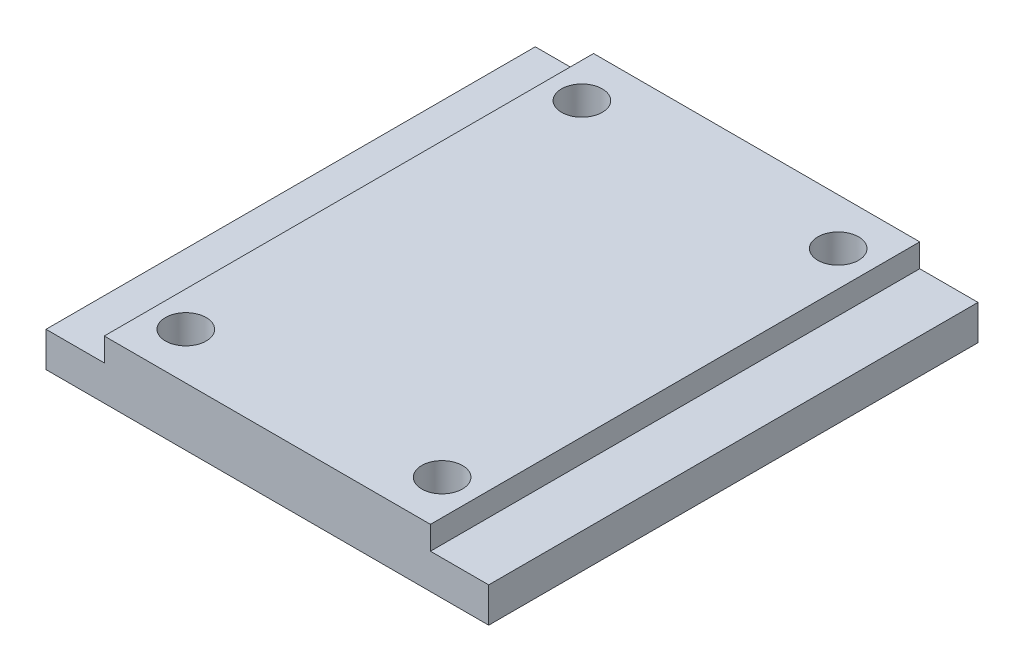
from build123d import *

# Parameters (mm, degrees)
BOSS_EXTRU_1_DEPTH        = 21
ESQUISSE2_R               = 1.75
ENL_V_MAT_EXTRU_1_DEPTH   = 29.757607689
ENL_V_MAT_EXTRU_2_DEPTH   = 2.5
SYM_TRIE2_COPY_1_SKETCH_R = 1.75
SYM_TRIE2_COPY_1_DEPTH    = 29.757607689
SYM_TRIE2_COPY_2_DEPTH    = 2.5


with BuildPart() as part:
    # Esquisse1 → Boss.-Extru.1 (new, symmetric)
    with BuildSketch(Plane.XY):
        Polygon((0, 0), (-19, 0), (-19, 3), (-14, 3), (-14, 5), (0, 5), align=None)
    boss_extru_1 = extrude(amount=BOSS_EXTRU_1_DEPTH, both=True)

    # Esquisse2 → Enl_v. mat.-Extru.1 (cut, through all)
    with BuildSketch(Plane(origin=(0, 5, 0), x_dir=(1, 0, 0), z_dir=(0, 1, 0))):
        with Locations(Location((-11, -17, 0), (0, 0, 270))):
            Circle(ESQUISSE2_R)
    enl_v_mat_extru_1 = extrude(amount=-ENL_V_MAT_EXTRU_1_DEPTH, mode=Mode.SUBTRACT)

    # Esquisse3 → Enl_v. mat.-Extru.2 (cut)
    with BuildSketch(Plane.XZ):
        Polygon((-8, 15.267949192), (-8, 18.732050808), (-11, 20.464101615), (-14, 18.732050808), (-14, 15.267949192), (-11, 13.535898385), align=None)
    enl_v_mat_extru_2 = extrude(amount=-ENL_V_MAT_EXTRU_2_DEPTH, mode=Mode.SUBTRACT)

    # Sym_trie1: Enl_v. mat.-Extru.1, Enl_v. mat.-Extru.2 across plane
    add(enl_v_mat_extru_1.mirror(Plane.XY), mode=Mode.SUBTRACT)
    add(enl_v_mat_extru_2.mirror(Plane.XY), mode=Mode.SUBTRACT)

    # Sym_trie2: Boss.-Extru.1, Enl_v. mat.-Extru.1, Enl_v. mat.-Extru.2 across plane
    add(boss_extru_1.mirror(Plane(origin=(0, 5, 21), x_dir=(0, 0, 1), z_dir=(-1, 0, 0))))
    add(enl_v_mat_extru_1.mirror(Plane(origin=(0, 5, 21), x_dir=(0, 0, 1), z_dir=(-1, 0, 0))), mode=Mode.SUBTRACT)
    add(enl_v_mat_extru_2.mirror(Plane(origin=(0, 5, 21), x_dir=(0, 0, 1), z_dir=(-1, 0, 0))), mode=Mode.SUBTRACT)

    # Sym_trie2 copy 1 sketch → Sym_trie2 copy 1 (cut, through all)
    with BuildSketch(Plane(origin=(0, 5, 0), x_dir=(-1, 0, 0), z_dir=(0, 1, 0))):
        with Locations(Location((-11, -17, 0), (0, 0, 270))):
            Circle(SYM_TRIE2_COPY_1_SKETCH_R)
    extrude(amount=-SYM_TRIE2_COPY_1_DEPTH, mode=Mode.SUBTRACT)

    # Sym_trie2 copy 2 sketch → Sym_trie2 copy 2 (cut)
    with BuildSketch(Plane(origin=(0, 0, 0), x_dir=(-1, 0, 0), z_dir=(0, -1, 0))):
        Polygon((-8, 15.267949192), (-8, 18.732050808), (-11, 20.464101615), (-14, 18.732050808), (-14, 15.267949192), (-11, 13.535898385), align=None)
    extrude(amount=-SYM_TRIE2_COPY_2_DEPTH, mode=Mode.SUBTRACT)


solid = part.part
